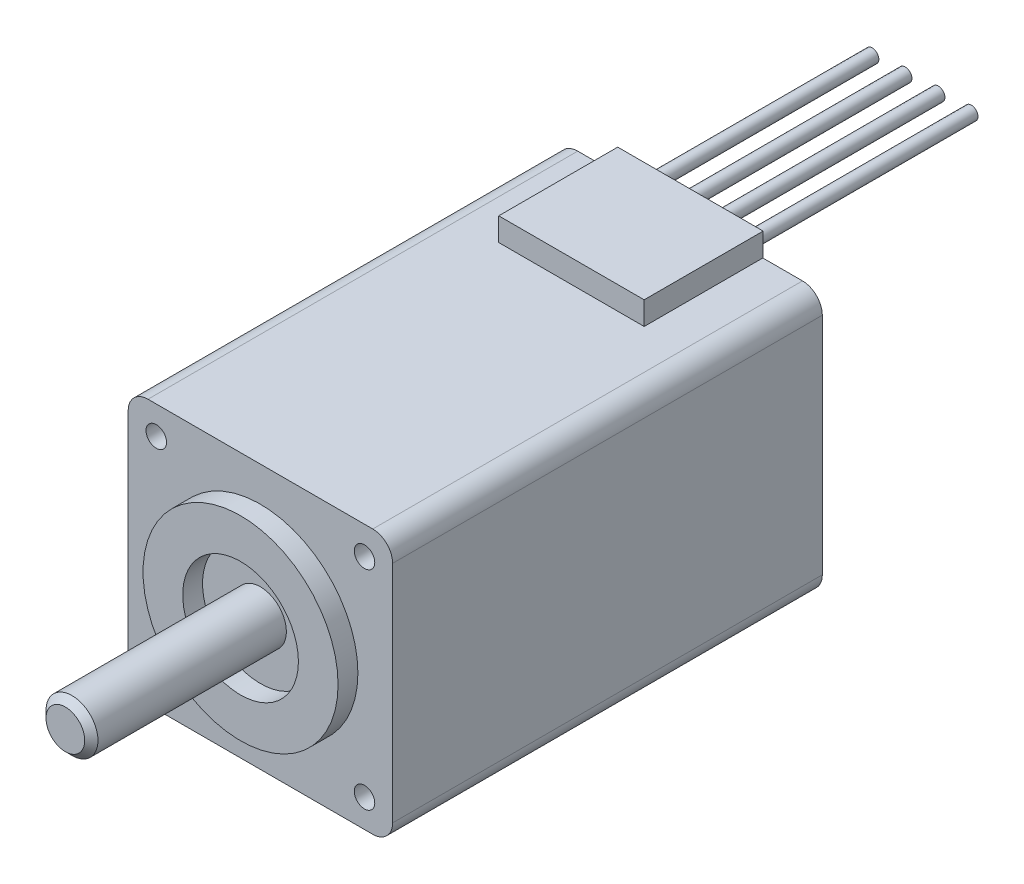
from build123d import *

# Parameters (mm, degrees)
SKETCH1_W                = 20.32
SKETCH1_H                = 33.02
BOSS_EXTRUDE1_DEPTH      = 20.32
SKETCH2_W                = 11.176
SKETCH2_H                = 2.032
BOSS_EXTRUDE2_DEPTH      = 0.0254
SKETCH3_W                = 11.176
SKETCH3_H                = 9.144
BOSS_EXTRUDE3_DEPTH      = 1.778
SKETCH4_R                = 7.493
BOSS_EXTRUDE4_DEPTH      = 1.524
M8_CLEARANCE_HOLE1_D     = 8.89
M8_CLEARANCE_HOLE1_DEPTH = 1.524
SKETCH7_W                = 0.508
SKETCH7_H                = 17.78
SKETCH8_W                = 0.508
SKETCH8_H                = 17.78
SKETCH9_W                = 0.508
SKETCH9_H                = 17.78
SKETCH10_W               = 0.508
SKETCH10_H               = 17.78
SKETCH11_W               = 1.99644
SKETCH11_H               = 14.986
M8_CLEARANCE_HOLE2_D     = 8.89
M8_CLEARANCE_HOLE2_DEPTH = 0.254
HOLE1_D                  = 1.5748
HOLE1_DEPTH              = 3.5052
HOLE1_TIP                = 0.473117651
CHAMFER1_SIZE            = 0.508
FILLET1_R                = 1.524


with BuildPart() as part:
    # Sketch1 → Boss-Extrude1 (new body)
    with BuildSketch(Plane.XZ.offset(10.16)):
        with Locations((0, 16.51)):
            Rectangle(SKETCH1_W, SKETCH1_H)
    extrude(amount=-BOSS_EXTRUDE1_DEPTH)

    # Sketch2 → Boss-Extrude2 (add)
    with BuildSketch(Plane(origin=(0, 0, 0), x_dir=(-1, 0, 0), z_dir=(0, 0, -1))):
        with Locations((0, 9.144)):
            Rectangle(SKETCH2_W, SKETCH2_H)
    extrude(amount=BOSS_EXTRUDE2_DEPTH)

    # Sketch3 → Boss-Extrude3 (add)
    with BuildSketch(Plane(origin=(0, 10.16, 0), x_dir=(-1, 0, 0), z_dir=(0, 1, 0))):
        with Locations((0, 4.5466)):
            Rectangle(SKETCH3_W, SKETCH3_H)
    extrude(amount=BOSS_EXTRUDE3_DEPTH)

    # Sketch4 → Boss-Extrude4 (add)
    with BuildSketch(Plane.XY.offset(33.02)):
        Circle(SKETCH4_R)
    extrude(amount=BOSS_EXTRUDE4_DEPTH)

    # M8 Clearance Hole1
    with Locations(Plane.XY.offset(34.544)):
        with Locations((0, 0)):
            Hole(M8_CLEARANCE_HOLE1_D / 2, depth=M8_CLEARANCE_HOLE1_DEPTH)

    # Sketch7 → Revolve1 (revolve)
    with BuildSketch(Plane.XZ.offset(-10.033), mode=Mode.PRIVATE) as revolve1_sk:
        with Locations((-3.556, -8.9154)):
            Rectangle(SKETCH7_W, SKETCH7_H)
    revolve(revolve1_sk.sketch.rotate(Axis((-3.81, 10.033, -0.0254), (0, 0, -1)), 180), axis=Axis((-3.81, 10.033, -0.0254), (0, 0, -1)))

    # Sketch8 → Revolve2 (revolve)
    with BuildSketch(Plane.XZ.offset(-10.033), mode=Mode.PRIVATE) as revolve2_sk:
        with Locations((1.524, -8.9154)):
            Rectangle(SKETCH8_W, SKETCH8_H)
    revolve(revolve2_sk.sketch.rotate(Axis((1.27, 10.033, -0.0254), (0, 0, -1)), 180), axis=Axis((1.27, 10.033, -0.0254), (0, 0, -1)))

    # Sketch9 → Revolve3 (revolve)
    with BuildSketch(Plane.XZ.offset(-10.033), mode=Mode.PRIVATE) as revolve3_sk:
        with Locations((4.064, -8.9154)):
            Rectangle(SKETCH9_W, SKETCH9_H)
    revolve(revolve3_sk.sketch.rotate(Axis((3.81, 10.033, -0.0254), (0, 0, -1)), 180), axis=Axis((3.81, 10.033, -0.0254), (0, 0, -1)))

    # Sketch10 → Revolve4 (revolve)
    with BuildSketch(Plane.XZ.offset(-10.033), mode=Mode.PRIVATE) as revolve4_sk:
        with Locations((-1.016, -8.9154)):
            Rectangle(SKETCH10_W, SKETCH10_H)
    revolve(revolve4_sk.sketch.rotate(Axis((-1.27, 10.033, -0.0254), (0, 0, -1)), 180), axis=Axis((-1.27, 10.033, -0.0254), (0, 0, -1)))

    # Sketch11 → Revolve5 (revolve)
    with BuildSketch(Plane(origin=(0, 0, 0), x_dir=(1, 0, 0), z_dir=(0, 1, 0))):
        with Locations((0.99822, -40.513)):
            Rectangle(SKETCH11_W, SKETCH11_H)
    revolve(axis=Axis((0, 0, 33.02), (0, 0, 1)))

    # M8 Clearance Hole2
    with Locations(Plane(origin=(0, 0, 0), x_dir=(-1, 0, 0), z_dir=(0, 0, -1))):
        with Locations((0, 0)):
            Hole(M8_CLEARANCE_HOLE2_D / 2, depth=M8_CLEARANCE_HOLE2_DEPTH)

    # Hole1
    with Locations(Plane.XY.offset(33.02)):
        with Locations((8.001, -8.001), (-8.001, 8.001), (-8.001, -8.001), (8.001, 8.001)):
            Hole(HOLE1_D / 2, depth=HOLE1_DEPTH)
            with Locations((0, 0, -(HOLE1_DEPTH + HOLE1_TIP / 2))):  # 118° drill point
                Cone(0, HOLE1_D / 2, HOLE1_TIP, mode=Mode.SUBTRACT)

    # Chamfer1
    chamfer1_edges = [part.edges().sort_by_distance(p)[0] for p in [
        (-1.99644, 0, 48.006),
    ]]
    chamfer(chamfer1_edges, length=CHAMFER1_SIZE)

    # Fillet1
    fillet1_edges = [part.edges().sort_by_distance(p)[0] for p in [
        (-10.16, 10.16, 16.51),
        (-10.16, -10.16, 16.51),
        (10.16, -10.16, 16.51),
        (10.16, 10.16, 16.51),
    ]]
    fillet(fillet1_edges, radius=FILLET1_R)


solid = part.part
